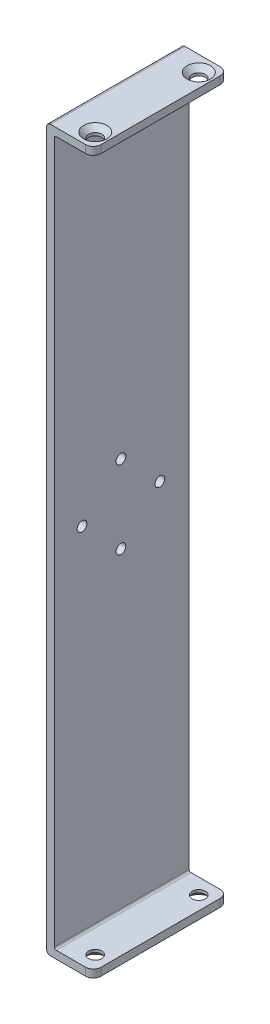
from build123d import *

# Parameters (mm, degrees)
BOSS_EXTRUDE1_DEPTH                                  = 34.6
CSK_FOR_M3_CROSS_RECESSED_CTSK_HEAD_WOOD_D           = 3.4
CSK_FOR_M3_CROSS_RECESSED_CTSK_HEAD_WOOD_DEPTH       = 4.5
CSK_FOR_M3_CROSS_RECESSED_CTSK_HEAD_WOOD_CSINK_D     = 6
CSK_FOR_M3_CROSS_RECESSED_CTSK_HEAD_WOOD_CSINK_ANGLE = 90
CSK_FOR_M3_CROSS_RECESSED_CTSK_HEAD_WOOD_TIP         = 1.021463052
FILLET1_R                                            = 1
FILLET2_R                                            = 0.5
CSK_FOR_M3_CROSS_RECESSED_CTSK_HEAD_2_D              = 3.4
CSK_FOR_M3_CROSS_RECESSED_CTSK_HEAD_2_DEPTH          = 4.5
CSK_FOR_M3_CROSS_RECESSED_CTSK_HEAD_2_CSINK_D        = 6
CSK_FOR_M3_CROSS_RECESSED_CTSK_HEAD_2_CSINK_ANGLE    = 90
CSK_FOR_M3_CROSS_RECESSED_CTSK_HEAD_2_TIP            = 1.021463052
M3_TAPPED_HOLE1_D                                    = 2.5
FILLET3_R                                            = 2


with BuildPart() as part:
    # Sketch1 → Boss-Extrude1 (new body)
    with BuildSketch(Plane.XY):
        Polygon((12, 183), (12, 185), (0, 185), (0, 0), (12, 0), (12, 2), (2, 2), (2, 183), align=None)
    extrude(amount=BOSS_EXTRUDE1_DEPTH)

    # CSK for M3 Cross recessed CTSK head wood
    with Locations(Plane(origin=(0, 185, 0), x_dir=(1, 0, 0), z_dir=(0, 1, 0))):
        with Locations((8.5, -4), (8.5, -30.6)):
            CounterSinkHole(CSK_FOR_M3_CROSS_RECESSED_CTSK_HEAD_WOOD_D / 2, CSK_FOR_M3_CROSS_RECESSED_CTSK_HEAD_WOOD_CSINK_D / 2, depth=CSK_FOR_M3_CROSS_RECESSED_CTSK_HEAD_WOOD_DEPTH, counter_sink_angle=CSK_FOR_M3_CROSS_RECESSED_CTSK_HEAD_WOOD_CSINK_ANGLE)
            with Locations((0, 0, -(CSK_FOR_M3_CROSS_RECESSED_CTSK_HEAD_WOOD_DEPTH + CSK_FOR_M3_CROSS_RECESSED_CTSK_HEAD_WOOD_TIP / 2))):  # 118° drill point
                Cone(0, CSK_FOR_M3_CROSS_RECESSED_CTSK_HEAD_WOOD_D / 2, CSK_FOR_M3_CROSS_RECESSED_CTSK_HEAD_WOOD_TIP, mode=Mode.SUBTRACT)

    # Fillet1
    fillet1_edges = [part.edges().sort_by_distance(p)[0] for p in [
        (0, 185, 17.3),
        (0, 0, 17.3),
    ]]
    fillet(fillet1_edges, radius=FILLET1_R)

    # Fillet2
    fillet2_edges = [part.edges().sort_by_distance(p)[0] for p in [
        (2, 183, 17.3),
        (2, 2, 17.3),
    ]]
    fillet(fillet2_edges, radius=FILLET2_R)

    # CSK for M3 Cross recessed CTSK head  2
    with Locations(Plane(origin=(0, 0, 0), x_dir=(-1, 0, 0), z_dir=(0, -1, 0))):
        with Locations((-8.5, -30.6), (-8.5, -4)):
            CounterSinkHole(CSK_FOR_M3_CROSS_RECESSED_CTSK_HEAD_2_D / 2, CSK_FOR_M3_CROSS_RECESSED_CTSK_HEAD_2_CSINK_D / 2, depth=CSK_FOR_M3_CROSS_RECESSED_CTSK_HEAD_2_DEPTH, counter_sink_angle=CSK_FOR_M3_CROSS_RECESSED_CTSK_HEAD_2_CSINK_ANGLE)
            with Locations((0, 0, -(CSK_FOR_M3_CROSS_RECESSED_CTSK_HEAD_2_DEPTH + CSK_FOR_M3_CROSS_RECESSED_CTSK_HEAD_2_TIP / 2))):  # 118° drill point
                Cone(0, CSK_FOR_M3_CROSS_RECESSED_CTSK_HEAD_2_D / 2, CSK_FOR_M3_CROSS_RECESSED_CTSK_HEAD_2_TIP, mode=Mode.SUBTRACT)

    # M3 Tapped Hole1 (through all)
    with Locations(Plane.ZY):
        with Locations((17.5, 102.5), (7.5, 92.5), (17.5, 82.5), (27.5, 92.5)):
            Hole(M3_TAPPED_HOLE1_D / 2)

    # Fillet3
    fillet3_edges = [part.edges().sort_by_distance(p)[0] for p in [
        (12, 1, 34.6),
        (12, 184, 34.6),
        (12, 184, 0),
        (12, 1, 0),
    ]]
    fillet(fillet3_edges, radius=FILLET3_R)


solid = part.part
